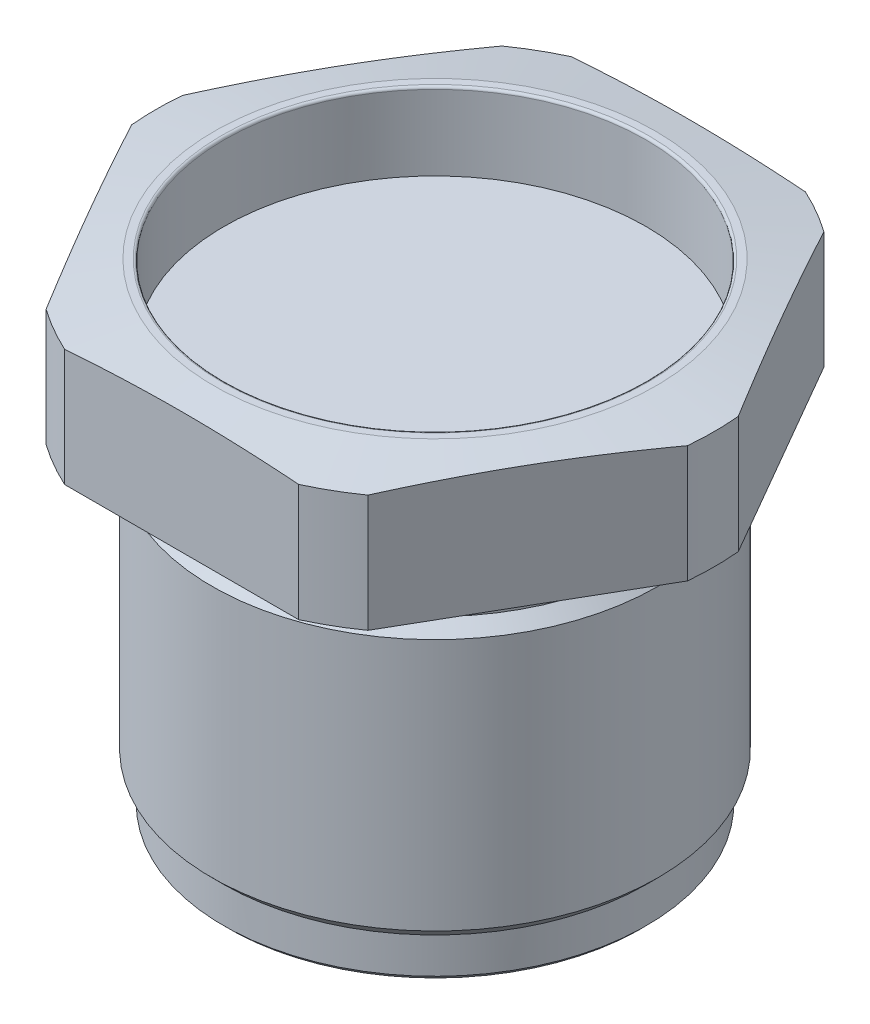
ISO-10303-21;
HEADER;
FILE_DESCRIPTION(('STEP AP214'),'2;1');
FILE_NAME('part.step','',(''),(''),'','','');
FILE_SCHEMA(('AUTOMOTIVE_DESIGN { 1 0 10303 214 1 1 1 1 }'));
ENDSEC;
DATA;
#1=APPLICATION_CONTEXT('core data for automotive mechanical design processes');
#2=APPLICATION_PROTOCOL_DEFINITION('international standard','automotive_design',2000,#1);
#3=PRODUCT_CONTEXT('',#1,'mechanical');
#4=PRODUCT('Part','Part','',(#3));
#5=PRODUCT_RELATED_PRODUCT_CATEGORY('part','',(#4));
#6=PRODUCT_DEFINITION_FORMATION('','',#4);
#7=PRODUCT_DEFINITION_CONTEXT('part definition',#1,'design');
#8=PRODUCT_DEFINITION('design','',#6,#7);
#9=PRODUCT_DEFINITION_SHAPE('','',#8);
#10=(LENGTH_UNIT() NAMED_UNIT(*) SI_UNIT(.MILLI.,.METRE.));
#11=(NAMED_UNIT(*) PLANE_ANGLE_UNIT() SI_UNIT($,.RADIAN.));
#12=(NAMED_UNIT(*) SI_UNIT($,.STERADIAN.) SOLID_ANGLE_UNIT());
#13=UNCERTAINTY_MEASURE_WITH_UNIT(LENGTH_MEASURE(1.E-05),#10,'distance_accuracy_value','');
#14=(GEOMETRIC_REPRESENTATION_CONTEXT(3) GLOBAL_UNCERTAINTY_ASSIGNED_CONTEXT((#13)) GLOBAL_UNIT_ASSIGNED_CONTEXT((#10,
#11,#12)) REPRESENTATION_CONTEXT('',''));
#15=CARTESIAN_POINT('',(0.,0.,0.));
#16=DIRECTION('',(0.,0.,1.));
#17=DIRECTION('',(1.,0.,0.));
#18=AXIS2_PLACEMENT_3D('',#15,#16,#17);
#19=CARTESIAN_POINT('',(21.0566,-34.8488,0.));
#20=DIRECTION('',(0.,-1.,0.));
#21=DIRECTION('',(0.,0.,-1.));
#22=AXIS2_PLACEMENT_3D('',#19,#20,#21);
#23=PLANE('',#22);
#24=CARTESIAN_POINT('',(0.,-34.8488,0.));
#25=DIRECTION('',(0.,-1.,0.));
#26=DIRECTION('',(0.,0.,-1.));
#27=AXIS2_PLACEMENT_3D('',#24,#25,#26);
#28=CIRCLE('',#27,18.8976);
#29=CARTESIAN_POINT('',(0.,-34.8488,-18.8976));
#30=VERTEX_POINT('',#29);
#31=EDGE_CURVE('E12',#30,#30,#28,.T.);
#32=ORIENTED_EDGE('',*,*,#31,.F.);
#33=EDGE_LOOP('',(#32));
#34=FACE_BOUND('',#33,.T.);
#35=CARTESIAN_POINT('',(0.,-34.8488,0.));
#36=DIRECTION('',(0.,-1.,0.));
#37=DIRECTION('',(0.,0.,-1.));
#38=AXIS2_PLACEMENT_3D('',#35,#36,#37);
#39=CIRCLE('',#38,20.55660224);
#40=CARTESIAN_POINT('',(0.,-34.8488,-20.55660224));
#41=VERTEX_POINT('',#40);
#42=EDGE_CURVE('E179',#41,#41,#39,.T.);
#43=ORIENTED_EDGE('',*,*,#42,.T.);
#44=EDGE_LOOP('',(#43));
#45=FACE_BOUND('',#44,.T.);
#46=ADVANCED_FACE('F35',(#34,#45),#23,.T.);
#47=CARTESIAN_POINT('',(0.,-8.96894233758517,0.));
#48=DIRECTION('',(0.,-1.,0.));
#49=DIRECTION('',(0.,0.,-1.));
#50=AXIS2_PLACEMENT_3D('',#47,#48,#49);
#51=CYLINDRICAL_SURFACE('',#50,21.0566);
#52=CARTESIAN_POINT('',(0.,-1.016,0.));
#53=DIRECTION('',(0.,-1.,0.));
#54=DIRECTION('',(0.,0.,-1.));
#55=AXIS2_PLACEMENT_3D('',#52,#53,#54);
#56=CIRCLE('',#55,21.0566);
#57=CARTESIAN_POINT('',(0.,-1.016,-21.0566));
#58=VERTEX_POINT('',#57);
#59=EDGE_CURVE('E191',#58,#58,#56,.T.);
#60=ORIENTED_EDGE('',*,*,#59,.T.);
#61=EDGE_LOOP('',(#60));
#62=FACE_BOUND('',#61,.T.);
#63=CARTESIAN_POINT('',(0.,-3.302,0.));
#64=DIRECTION('',(0.,-1.,0.));
#65=DIRECTION('',(1.,0.,0.));
#66=AXIS2_PLACEMENT_3D('',#63,#64,#65);
#67=CIRCLE('',#66,21.0566);
#68=CARTESIAN_POINT('',(21.0566,-3.302,0.));
#69=VERTEX_POINT('',#68);
#70=EDGE_CURVE('E188',#69,#69,#67,.T.);
#71=ORIENTED_EDGE('',*,*,#70,.F.);
#72=EDGE_LOOP('',(#71));
#73=FACE_BOUND('',#72,.T.);
#74=ADVANCED_FACE('F304',(#62,#73),#51,.T.);
#75=CARTESIAN_POINT('',(0.,11.6743764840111,0.));
#76=DIRECTION('',(0.,-1.,0.));
#77=DIRECTION('',(0.,0.,-1.));
#78=AXIS2_PLACEMENT_3D('',#75,#76,#77);
#79=CONICAL_SURFACE('',#78,27.813,1.39626340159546);
#80=CARTESIAN_POINT('',(0.,12.7,0.));
#81=DIRECTION('',(0.,-1.,0.));
#82=DIRECTION('',(0.,0.,-1.));
#83=AXIS2_PLACEMENT_3D('',#80,#81,#82);
#84=CIRCLE('',#83,21.9964);
#85=CARTESIAN_POINT('',(0.,12.7,-21.9964));
#86=VERTEX_POINT('',#85);
#87=EDGE_CURVE('E283',#86,#86,#84,.T.);
#88=ORIENTED_EDGE('',*,*,#87,.T.);
#89=EDGE_LOOP('',(#88));
#90=FACE_BOUND('',#89,.T.);
#91=CARTESIAN_POINT('',(0.,11.6743764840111,0.));
#92=DIRECTION('',(0.,-1.,0.));
#93=DIRECTION('',(0.,0.,-1.));
#94=AXIS2_PLACEMENT_3D('',#91,#92,#93);
#95=CIRCLE('',#94,27.813);
#96=CARTESIAN_POINT('',(-27.6981005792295,11.6743764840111,2.52550852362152));
#97=VERTEX_POINT('',#96);
#98=CARTESIAN_POINT('',(-27.6981005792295,11.6743764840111,-2.5255085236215));
#99=VERTEX_POINT('',#98);
#100=EDGE_CURVE('E139',#97,#99,#95,.T.);
#101=ORIENTED_EDGE('',*,*,#100,.F.);
#102=CARTESIAN_POINT('',(-27.699453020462,11.6741764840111,2.52316602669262));
#103=CARTESIAN_POINT('',(-27.4566948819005,11.7100797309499,2.94363545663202));
#104=CARTESIAN_POINT('',(-27.2138691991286,11.7441442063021,3.36422187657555));
#105=CARTESIAN_POINT('',(-26.7280857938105,11.8083518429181,4.20562341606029));
#106=CARTESIAN_POINT('',(-26.485128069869,11.8384949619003,4.62643853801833));
#107=CARTESIAN_POINT('',(-25.7560383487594,11.9226790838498,5.88925897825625));
#108=CARTESIAN_POINT('',(-25.269720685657,11.9704702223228,6.73158587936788));
#109=CARTESIAN_POINT('',(-24.2974521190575,12.0476317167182,8.41560443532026));
#110=CARTESIAN_POINT('',(-23.8115017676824,12.077029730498,9.25729513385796));
#111=CARTESIAN_POINT('',(-22.8394185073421,12.1163636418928,10.9409927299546));
#112=CARTESIAN_POINT('',(-22.3532856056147,12.1263002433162,11.7829996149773));
#113=CARTESIAN_POINT('',(-21.3810198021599,12.1263002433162,13.4670133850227));
#114=CARTESIAN_POINT('',(-20.8948869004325,12.1163636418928,14.3090202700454));
#115=CARTESIAN_POINT('',(-19.9228036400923,12.077029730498,15.992717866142));
#116=CARTESIAN_POINT('',(-19.4368532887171,12.0476317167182,16.8344085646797));
#117=CARTESIAN_POINT('',(-18.4645847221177,11.9704702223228,18.5184271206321));
#118=CARTESIAN_POINT('',(-17.9782670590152,11.9226790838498,19.3607540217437));
#119=CARTESIAN_POINT('',(-17.2491773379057,11.8384949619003,20.6235744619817));
#120=CARTESIAN_POINT('',(-17.0062196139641,11.8083518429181,21.0443895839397));
#121=CARTESIAN_POINT('',(-16.5204362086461,11.7441442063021,21.8857911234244));
#122=CARTESIAN_POINT('',(-16.2776105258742,11.7100797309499,22.306377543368));
#123=CARTESIAN_POINT('',(-16.0348523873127,11.6741764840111,22.7268469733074));
#124=B_SPLINE_CURVE_WITH_KNOTS('',3,(#102,#103,#104,#105,#106,#107,#108,#109,#110,#111,#112,
#113,#114,#115,#116,#117,#118,#119,#120,#121,#122,#123),.UNSPECIFIED.,.F.,.F.,(4,2,2,2,2,2,2,2,
2,2,4),(0.,1.46051952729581,2.92105480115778,5.84231114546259,8.75916415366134,11.6759116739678,
14.5926591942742,17.5095122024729,20.4307685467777,21.8913038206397,23.3518233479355),.UNSPECIFIED.);
#125=CARTESIAN_POINT('',(-16.0362048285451,11.6743764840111,22.7245044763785));
#126=VERTEX_POINT('',#125);
#127=EDGE_CURVE('E273',#97,#126,#124,.T.);
#128=ORIENTED_EDGE('',*,*,#127,.T.);
#129=CARTESIAN_POINT('',(-11.6618957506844,11.6743764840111,25.250013));
#130=VERTEX_POINT('',#129);
#131=EDGE_CURVE('E397',#130,#126,#95,.T.);
#132=ORIENTED_EDGE('',*,*,#131,.F.);
#133=CARTESIAN_POINT('',(-38.45442568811,8.466931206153,25.250013));
#134=CARTESIAN_POINT('',(-37.3088939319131,8.63573012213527,25.250013));
#135=CARTESIAN_POINT('',(-36.1630410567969,8.80238834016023,25.250013));
#136=CARTESIAN_POINT('',(-33.8705391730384,9.1302907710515,25.250013));
#137=CARTESIAN_POINT('',(-32.7238901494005,9.2915348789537,25.250013));
#138=CARTESIAN_POINT('',(-30.4291954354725,9.60753746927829,25.250013));
#139=CARTESIAN_POINT('',(-29.2811493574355,9.76229314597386,25.250013));
#140=CARTESIAN_POINT('',(-26.9839990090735,10.0637355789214,25.250013));
#141=CARTESIAN_POINT('',(-25.8348947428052,10.2104223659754,25.250013));
#142=CARTESIAN_POINT('',(-23.5393242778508,10.4933831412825,25.250013));
#143=CARTESIAN_POINT('',(-22.3928622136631,10.6296905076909,25.250013));
#144=CARTESIAN_POINT('',(-20.0985472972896,10.890150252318,25.250013));
#145=CARTESIAN_POINT('',(-18.9506944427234,11.0143026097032,25.250013));
#146=CARTESIAN_POINT('',(-16.653535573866,11.2476996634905,25.250013));
#147=CARTESIAN_POINT('',(-15.5042296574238,11.3569453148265,25.250013));
#148=CARTESIAN_POINT('',(-13.2040281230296,11.5573856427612,25.250013));
#149=CARTESIAN_POINT('',(-12.0531325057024,11.6485803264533,25.250013));
#150=CARTESIAN_POINT('',(-9.74440831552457,11.809935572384,25.250013));
#151=CARTESIAN_POINT('',(-8.5865725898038,11.87999521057,25.250013));
#152=CARTESIAN_POINT('',(-6.26965491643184,11.9952859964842,25.250013));
#153=CARTESIAN_POINT('',(-5.11057297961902,12.040517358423,25.250013));
#154=CARTESIAN_POINT('',(-2.79186198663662,12.1037192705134,25.250013));
#155=CARTESIAN_POINT('',(-1.632233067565,12.121694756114,25.250013));
#156=CARTESIAN_POINT('',(0.687119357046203,12.1293464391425,25.250013));
#157=CARTESIAN_POINT('',(1.84684286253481,12.1190226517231,25.250013));
#158=CARTESIAN_POINT('',(4.16752278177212,12.0706496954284,25.250013));
#159=CARTESIAN_POINT('',(5.32847827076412,12.0325570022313,25.250013));
#160=CARTESIAN_POINT('',(7.6492527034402,11.9307119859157,25.250013));
#161=CARTESIAN_POINT('',(8.80907163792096,11.8669594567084,25.250013));
#162=CARTESIAN_POINT('',(11.1275218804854,11.7168527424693,25.250013));
#163=CARTESIAN_POINT('',(12.2861528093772,11.6304927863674,25.250013));
#164=CARTESIAN_POINT('',(14.601809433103,11.4386022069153,25.250013));
#165=CARTESIAN_POINT('',(15.7588351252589,11.3330715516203,25.250013));
#166=CARTESIAN_POINT('',(18.0088025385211,11.1122678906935,25.250013));
#167=CARTESIAN_POINT('',(19.1018270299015,10.9978300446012,25.250013));
#168=CARTESIAN_POINT('',(21.2865901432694,10.7572197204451,25.250013));
#169=CARTESIAN_POINT('',(22.3783287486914,10.6310470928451,25.250013));
#170=CARTESIAN_POINT('',(24.5606961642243,10.3690640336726,25.250013));
#171=CARTESIAN_POINT('',(25.6513249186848,10.2332531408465,25.250013));
#172=CARTESIAN_POINT('',(27.831561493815,9.9537333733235,25.250013));
#173=CARTESIAN_POINT('',(28.9211693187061,9.81002453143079,25.250013));
#174=CARTESIAN_POINT('',(31.0996706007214,9.51609433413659,25.250013));
#175=CARTESIAN_POINT('',(32.1885639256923,9.3658720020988,25.250013));
#176=CARTESIAN_POINT('',(34.3655970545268,9.06006925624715,25.250013));
#177=CARTESIAN_POINT('',(35.4537368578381,8.90448883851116,25.250013));
#178=CARTESIAN_POINT('',(37.6293381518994,8.58888814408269,25.250013));
#179=CARTESIAN_POINT('',(38.7167996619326,8.42886800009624,25.250013));
#180=CARTESIAN_POINT('',(40.8911698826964,8.10511156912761,25.250013));
#181=CARTESIAN_POINT('',(41.9780785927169,7.94137527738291,25.250013));
#182=CARTESIAN_POINT('',(45.2288133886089,7.44692280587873,25.250013));
#183=CARTESIAN_POINT('',(47.3919393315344,7.11160393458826,25.250013));
#184=CARTESIAN_POINT('',(51.7168144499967,6.43212081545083,25.250013));
#185=CARTESIAN_POINT('',(53.8785636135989,6.08795649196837,25.250013));
#186=CARTESIAN_POINT('',(58.199655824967,5.39328895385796,25.250013));
#187=CARTESIAN_POINT('',(60.3589995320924,5.04278983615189,25.250013));
#188=CARTESIAN_POINT('',(63.5973888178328,4.51332317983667,25.250013));
#189=CARTESIAN_POINT('',(64.6767392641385,4.33621600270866,25.250013));
#190=CARTESIAN_POINT('',(66.835259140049,3.98090532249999,25.250013));
#191=CARTESIAN_POINT('',(67.9144285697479,3.80270181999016,25.250013));
#192=CARTESIAN_POINT('',(68.9935191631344,3.62402199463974,25.250013));
#193=B_SPLINE_CURVE_WITH_KNOTS('',3,(#133,#134,#135,#136,#137,#138,#139,#140,#141,#142,#143,
#144,#145,#146,#147,#148,#149,#150,#151,#152,#153,#154,#155,#156,#157,#158,#159,#160,#161,#162,
#163,#164,#165,#166,#167,#168,#169,#170,#171,#172,#173,#174,#175,#176,#177,#178,#179,#180,#181,
#182,#183,#184,#185,#186,#187,#188,#189,#190,#191,#192),.UNSPECIFIED.,.F.,.F.,(4,2,2,2,2,2,2,2,
2,2,2,2,2,2,2,2,2,2,2,2,2,2,2,2,2,2,2,2,2,4),(0.,3.47371114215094,6.9474895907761,
10.4227549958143,13.8980071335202,17.3615650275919,20.8251288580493,24.2884707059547,
27.7518111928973,31.2314371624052,34.7110331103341,38.1899989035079,41.6689628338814,
45.1533913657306,48.637847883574,52.1231947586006,55.6085474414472,58.9054693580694,
62.2024332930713,65.4995551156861,68.796663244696,72.0942674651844,75.3918740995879,
78.6893822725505,81.9868946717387,88.5537497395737,95.1206609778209,101.683467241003,
104.964820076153,108.246171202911),.UNSPECIFIED.);
#194=CARTESIAN_POINT('',(11.6618957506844,11.6743764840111,25.250013));
#195=VERTEX_POINT('',#194);
#196=EDGE_CURVE('E380',#130,#195,#193,.T.);
#197=ORIENTED_EDGE('',*,*,#196,.T.);
#198=CARTESIAN_POINT('',(16.0362048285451,11.6743764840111,22.7245044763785));
#199=VERTEX_POINT('',#198);
#200=EDGE_CURVE('E406',#199,#195,#95,.T.);
#201=ORIENTED_EDGE('',*,*,#200,.F.);
#202=CARTESIAN_POINT('',(16.0348523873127,11.6741764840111,22.7268469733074));
#203=CARTESIAN_POINT('',(16.2776105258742,11.7100797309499,22.306377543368));
#204=CARTESIAN_POINT('',(16.5204362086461,11.7441442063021,21.8857911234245));
#205=CARTESIAN_POINT('',(17.0062196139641,11.8083518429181,21.0443895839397));
#206=CARTESIAN_POINT('',(17.2491773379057,11.8384949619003,20.6235744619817));
#207=CARTESIAN_POINT('',(17.9782670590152,11.9226790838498,19.3607540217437));
#208=CARTESIAN_POINT('',(18.4645847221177,11.9704702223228,18.5184271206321));
#209=CARTESIAN_POINT('',(19.4368532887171,12.0476317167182,16.8344085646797));
#210=CARTESIAN_POINT('',(19.9228036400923,12.077029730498,15.992717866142));
#211=CARTESIAN_POINT('',(20.8948869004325,12.1163636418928,14.3090202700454));
#212=CARTESIAN_POINT('',(21.3810198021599,12.1263002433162,13.4670133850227));
#213=CARTESIAN_POINT('',(22.3532856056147,12.1263002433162,11.7829996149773));
#214=CARTESIAN_POINT('',(22.8394185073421,12.1163636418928,10.9409927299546));
#215=CARTESIAN_POINT('',(23.8115017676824,12.077029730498,9.25729513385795));
#216=CARTESIAN_POINT('',(24.2974521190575,12.0476317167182,8.41560443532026));
#217=CARTESIAN_POINT('',(25.269720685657,11.9704702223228,6.73158587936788));
#218=CARTESIAN_POINT('',(25.7560383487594,11.9226790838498,5.88925897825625));
#219=CARTESIAN_POINT('',(26.485128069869,11.8384949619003,4.62643853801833));
#220=CARTESIAN_POINT('',(26.7280857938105,11.8083518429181,4.20562341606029));
#221=CARTESIAN_POINT('',(27.2138691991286,11.7441442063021,3.36422187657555));
#222=CARTESIAN_POINT('',(27.4566948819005,11.7100797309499,2.94363545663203));
#223=CARTESIAN_POINT('',(27.699453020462,11.6741764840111,2.52316602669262));
#224=B_SPLINE_CURVE_WITH_KNOTS('',3,(#202,#203,#204,#205,#206,#207,#208,#209,#210,#211,#212,
#213,#214,#215,#216,#217,#218,#219,#220,#221,#222,#223),.UNSPECIFIED.,.F.,.F.,(4,2,2,2,2,2,2,2,
2,2,4),(0.,1.46051952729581,2.92105480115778,5.84231114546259,8.75916415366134,11.6759116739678,
14.5926591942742,17.5095122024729,20.4307685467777,21.8913038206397,23.3518233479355),.UNSPECIFIED.);
#225=CARTESIAN_POINT('',(27.6981005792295,11.6743764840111,2.5255085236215));
#226=VERTEX_POINT('',#225);
#227=EDGE_CURVE('E408',#199,#226,#224,.T.);
#228=ORIENTED_EDGE('',*,*,#227,.T.);
#229=CARTESIAN_POINT('',(27.6981005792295,11.6743764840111,-2.52550852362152));
#230=VERTEX_POINT('',#229);
#231=EDGE_CURVE('E162',#230,#226,#95,.T.);
#232=ORIENTED_EDGE('',*,*,#231,.F.);
#233=CARTESIAN_POINT('',(27.699453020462,11.6741764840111,-2.52316602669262));
#234=CARTESIAN_POINT('',(27.4566948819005,11.7100797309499,-2.94363545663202));
#235=CARTESIAN_POINT('',(27.2138691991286,11.7441442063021,-3.36422187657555));
#236=CARTESIAN_POINT('',(26.7280857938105,11.8083518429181,-4.20562341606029));
#237=CARTESIAN_POINT('',(26.485128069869,11.8384949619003,-4.62643853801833));
#238=CARTESIAN_POINT('',(25.7560383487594,11.9226790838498,-5.88925897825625));
#239=CARTESIAN_POINT('',(25.269720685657,11.9704702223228,-6.73158587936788));
#240=CARTESIAN_POINT('',(24.2974521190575,12.0476317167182,-8.41560443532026));
#241=CARTESIAN_POINT('',(23.8115017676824,12.077029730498,-9.25729513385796));
#242=CARTESIAN_POINT('',(22.8394185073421,12.1163636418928,-10.9409927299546));
#243=CARTESIAN_POINT('',(22.3532856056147,12.1263002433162,-11.7829996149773));
#244=CARTESIAN_POINT('',(21.3810198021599,12.1263002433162,-13.4670133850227));
#245=CARTESIAN_POINT('',(20.8948869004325,12.1163636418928,-14.3090202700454));
#246=CARTESIAN_POINT('',(19.9228036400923,12.077029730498,-15.992717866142));
#247=CARTESIAN_POINT('',(19.4368532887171,12.0476317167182,-16.8344085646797));
#248=CARTESIAN_POINT('',(18.4645847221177,11.9704702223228,-18.5184271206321));
#249=CARTESIAN_POINT('',(17.9782670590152,11.9226790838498,-19.3607540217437));
#250=CARTESIAN_POINT('',(17.2491773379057,11.8384949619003,-20.6235744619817));
#251=CARTESIAN_POINT('',(17.0062196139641,11.8083518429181,-21.0443895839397));
#252=CARTESIAN_POINT('',(16.5204362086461,11.7441442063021,-21.8857911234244));
#253=CARTESIAN_POINT('',(16.2776105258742,11.7100797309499,-22.306377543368));
#254=CARTESIAN_POINT('',(16.0348523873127,11.6741764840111,-22.7268469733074));
#255=B_SPLINE_CURVE_WITH_KNOTS('',3,(#233,#234,#235,#236,#237,#238,#239,#240,#241,#242,#243,
#244,#245,#246,#247,#248,#249,#250,#251,#252,#253,#254),.UNSPECIFIED.,.F.,.F.,(4,2,2,2,2,2,2,2,
2,2,4),(0.,1.46051952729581,2.92105480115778,5.84231114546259,8.75916415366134,11.6759116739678,
14.5926591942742,17.5095122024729,20.4307685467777,21.8913038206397,23.3518233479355),.UNSPECIFIED.);
#256=CARTESIAN_POINT('',(16.0362048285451,11.6743764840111,-22.7245044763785));
#257=VERTEX_POINT('',#256);
#258=EDGE_CURVE('E422',#230,#257,#255,.T.);
#259=ORIENTED_EDGE('',*,*,#258,.T.);
#260=CARTESIAN_POINT('',(11.6618957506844,11.6743764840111,-25.250013));
#261=VERTEX_POINT('',#260);
#262=EDGE_CURVE('E158',#261,#257,#95,.T.);
#263=ORIENTED_EDGE('',*,*,#262,.F.);
#264=CARTESIAN_POINT('',(-38.45442568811,8.466931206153,-25.250013));
#265=CARTESIAN_POINT('',(-37.3088939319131,8.63573012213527,-25.250013));
#266=CARTESIAN_POINT('',(-36.1630410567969,8.80238834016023,-25.250013));
#267=CARTESIAN_POINT('',(-33.8705391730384,9.1302907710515,-25.250013));
#268=CARTESIAN_POINT('',(-32.7238901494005,9.2915348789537,-25.250013));
#269=CARTESIAN_POINT('',(-30.4291954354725,9.60753746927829,-25.250013));
#270=CARTESIAN_POINT('',(-29.2811493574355,9.76229314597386,-25.250013));
#271=CARTESIAN_POINT('',(-26.9839990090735,10.0637355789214,-25.250013));
#272=CARTESIAN_POINT('',(-25.8348947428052,10.2104223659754,-25.250013));
#273=CARTESIAN_POINT('',(-23.5393242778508,10.4933831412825,-25.250013));
#274=CARTESIAN_POINT('',(-22.3928622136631,10.6296905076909,-25.250013));
#275=CARTESIAN_POINT('',(-20.0985472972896,10.890150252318,-25.250013));
#276=CARTESIAN_POINT('',(-18.9506944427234,11.0143026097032,-25.250013));
#277=CARTESIAN_POINT('',(-16.653535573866,11.2476996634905,-25.250013));
#278=CARTESIAN_POINT('',(-15.5042296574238,11.3569453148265,-25.250013));
#279=CARTESIAN_POINT('',(-13.2040281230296,11.5573856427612,-25.250013));
#280=CARTESIAN_POINT('',(-12.0531325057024,11.6485803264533,-25.250013));
#281=CARTESIAN_POINT('',(-9.74440831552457,11.809935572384,-25.250013));
#282=CARTESIAN_POINT('',(-8.5865725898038,11.87999521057,-25.250013));
#283=CARTESIAN_POINT('',(-6.26965491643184,11.9952859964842,-25.250013));
#284=CARTESIAN_POINT('',(-5.11057297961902,12.040517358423,-25.250013));
#285=CARTESIAN_POINT('',(-2.79186198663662,12.1037192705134,-25.250013));
#286=CARTESIAN_POINT('',(-1.632233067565,12.121694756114,-25.250013));
#287=CARTESIAN_POINT('',(0.687119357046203,12.1293464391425,-25.250013));
#288=CARTESIAN_POINT('',(1.84684286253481,12.1190226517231,-25.250013));
#289=CARTESIAN_POINT('',(4.16752278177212,12.0706496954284,-25.250013));
#290=CARTESIAN_POINT('',(5.32847827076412,12.0325570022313,-25.250013));
#291=CARTESIAN_POINT('',(7.6492527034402,11.9307119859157,-25.250013));
#292=CARTESIAN_POINT('',(8.80907163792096,11.8669594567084,-25.250013));
#293=CARTESIAN_POINT('',(11.1275218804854,11.7168527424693,-25.250013));
#294=CARTESIAN_POINT('',(12.2861528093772,11.6304927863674,-25.250013));
#295=CARTESIAN_POINT('',(14.601809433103,11.4386022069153,-25.250013));
#296=CARTESIAN_POINT('',(15.7588351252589,11.3330715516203,-25.250013));
#297=CARTESIAN_POINT('',(18.0088025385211,11.1122678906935,-25.250013));
#298=CARTESIAN_POINT('',(19.1018270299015,10.9978300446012,-25.250013));
#299=CARTESIAN_POINT('',(21.2865901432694,10.7572197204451,-25.250013));
#300=CARTESIAN_POINT('',(22.3783287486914,10.6310470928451,-25.250013));
#301=CARTESIAN_POINT('',(24.5606961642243,10.3690640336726,-25.250013));
#302=CARTESIAN_POINT('',(25.6513249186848,10.2332531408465,-25.250013));
#303=CARTESIAN_POINT('',(27.831561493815,9.9537333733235,-25.250013));
#304=CARTESIAN_POINT('',(28.9211693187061,9.81002453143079,-25.250013));
#305=CARTESIAN_POINT('',(31.0996706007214,9.51609433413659,-25.250013));
#306=CARTESIAN_POINT('',(32.1885639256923,9.3658720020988,-25.250013));
#307=CARTESIAN_POINT('',(34.3655970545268,9.06006925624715,-25.250013));
#308=CARTESIAN_POINT('',(35.4537368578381,8.90448883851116,-25.250013));
#309=CARTESIAN_POINT('',(37.6293381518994,8.58888814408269,-25.250013));
#310=CARTESIAN_POINT('',(38.7167996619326,8.42886800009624,-25.250013));
#311=CARTESIAN_POINT('',(40.8911698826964,8.10511156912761,-25.250013));
#312=CARTESIAN_POINT('',(41.9780785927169,7.94137527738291,-25.250013));
#313=CARTESIAN_POINT('',(45.2288133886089,7.44692280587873,-25.250013));
#314=CARTESIAN_POINT('',(47.3919393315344,7.11160393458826,-25.250013));
#315=CARTESIAN_POINT('',(51.7168144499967,6.43212081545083,-25.250013));
#316=CARTESIAN_POINT('',(53.8785636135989,6.08795649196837,-25.250013));
#317=CARTESIAN_POINT('',(58.199655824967,5.39328895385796,-25.250013));
#318=CARTESIAN_POINT('',(60.3589995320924,5.04278983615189,-25.250013));
#319=CARTESIAN_POINT('',(63.5973888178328,4.51332317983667,-25.250013));
#320=CARTESIAN_POINT('',(64.6767392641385,4.33621600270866,-25.250013));
#321=CARTESIAN_POINT('',(66.835259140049,3.98090532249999,-25.250013));
#322=CARTESIAN_POINT('',(67.9144285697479,3.80270181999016,-25.250013));
#323=CARTESIAN_POINT('',(68.9935191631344,3.62402199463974,-25.250013));
#324=B_SPLINE_CURVE_WITH_KNOTS('',3,(#264,#265,#266,#267,#268,#269,#270,#271,#272,#273,#274,
#275,#276,#277,#278,#279,#280,#281,#282,#283,#284,#285,#286,#287,#288,#289,#290,#291,#292,#293,
#294,#295,#296,#297,#298,#299,#300,#301,#302,#303,#304,#305,#306,#307,#308,#309,#310,#311,#312,
#313,#314,#315,#316,#317,#318,#319,#320,#321,#322,#323),.UNSPECIFIED.,.F.,.F.,(4,2,2,2,2,2,2,2,
2,2,2,2,2,2,2,2,2,2,2,2,2,2,2,2,2,2,2,2,2,4),(0.,3.47371114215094,6.9474895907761,
10.4227549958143,13.8980071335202,17.3615650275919,20.8251288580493,24.2884707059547,
27.7518111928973,31.2314371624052,34.7110331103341,38.1899989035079,41.6689628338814,
45.1533913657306,48.637847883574,52.1231947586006,55.6085474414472,58.9054693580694,
62.2024332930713,65.4995551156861,68.796663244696,72.0942674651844,75.3918740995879,
78.6893822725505,81.9868946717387,88.5537497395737,95.1206609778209,101.683467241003,
104.964820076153,108.246171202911),.UNSPECIFIED.);
#325=CARTESIAN_POINT('',(-11.6618957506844,11.6743764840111,-25.250013));
#326=VERTEX_POINT('',#325);
#327=EDGE_CURVE('E456',#261,#326,#324,.F.);
#328=ORIENTED_EDGE('',*,*,#327,.T.);
#329=CARTESIAN_POINT('',(-16.0362048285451,11.6743764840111,-22.7245044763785));
#330=VERTEX_POINT('',#329);
#331=EDGE_CURVE('E155',#330,#326,#95,.T.);
#332=ORIENTED_EDGE('',*,*,#331,.F.);
#333=CARTESIAN_POINT('',(-16.0348523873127,11.6741764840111,-22.7268469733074));
#334=CARTESIAN_POINT('',(-16.2776105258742,11.7100797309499,-22.306377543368));
#335=CARTESIAN_POINT('',(-16.5204362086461,11.7441442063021,-21.8857911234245));
#336=CARTESIAN_POINT('',(-17.0062196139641,11.8083518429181,-21.0443895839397));
#337=CARTESIAN_POINT('',(-17.2491773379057,11.8384949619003,-20.6235744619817));
#338=CARTESIAN_POINT('',(-17.9782670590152,11.9226790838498,-19.3607540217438));
#339=CARTESIAN_POINT('',(-18.4645847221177,11.9704702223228,-18.5184271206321));
#340=CARTESIAN_POINT('',(-19.4368532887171,12.0476317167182,-16.8344085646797));
#341=CARTESIAN_POINT('',(-19.9228036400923,12.077029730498,-15.992717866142));
#342=CARTESIAN_POINT('',(-20.8948869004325,12.1163636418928,-14.3090202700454));
#343=CARTESIAN_POINT('',(-21.3810198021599,12.1263002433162,-13.4670133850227));
#344=CARTESIAN_POINT('',(-22.3532856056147,12.1263002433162,-11.7829996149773));
#345=CARTESIAN_POINT('',(-22.8394185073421,12.1163636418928,-10.9409927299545));
#346=CARTESIAN_POINT('',(-23.8115017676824,12.077029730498,-9.25729513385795));
#347=CARTESIAN_POINT('',(-24.2974521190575,12.0476317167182,-8.41560443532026));
#348=CARTESIAN_POINT('',(-25.269720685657,11.9704702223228,-6.73158587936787));
#349=CARTESIAN_POINT('',(-25.7560383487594,11.9226790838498,-5.88925897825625));
#350=CARTESIAN_POINT('',(-26.485128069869,11.8384949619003,-4.62643853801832));
#351=CARTESIAN_POINT('',(-26.7280857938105,11.8083518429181,-4.20562341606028));
#352=CARTESIAN_POINT('',(-27.2138691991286,11.7441442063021,-3.36422187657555));
#353=CARTESIAN_POINT('',(-27.4566948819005,11.7100797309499,-2.94363545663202));
#354=CARTESIAN_POINT('',(-27.699453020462,11.6741764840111,-2.52316602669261));
#355=B_SPLINE_CURVE_WITH_KNOTS('',3,(#333,#334,#335,#336,#337,#338,#339,#340,#341,#342,#343,
#344,#345,#346,#347,#348,#349,#350,#351,#352,#353,#354),.UNSPECIFIED.,.F.,.F.,(4,2,2,2,2,2,2,2,
2,2,4),(0.,1.46051952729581,2.92105480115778,5.84231114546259,8.75916415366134,11.6759116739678,
14.5926591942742,17.5095122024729,20.4307685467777,21.8913038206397,23.3518233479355),.UNSPECIFIED.);
#356=EDGE_CURVE('E140',#330,#99,#355,.T.);
#357=ORIENTED_EDGE('',*,*,#356,.T.);
#358=EDGE_LOOP('',(#101,#128,#132,#197,#201,#228,#232,#259,#263,#328,#332,#357));
#359=FACE_BOUND('',#358,.T.);
#360=ADVANCED_FACE('F252',(#90,#359),#79,.T.);
#361=CARTESIAN_POINT('',(0.,-8.96894233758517,0.));
#362=DIRECTION('',(0.,-1.,0.));
#363=DIRECTION('',(0.,0.,-1.));
#364=AXIS2_PLACEMENT_3D('',#361,#362,#363);
#365=CYLINDRICAL_SURFACE('',#364,27.813);
#366=CARTESIAN_POINT('',(0.,0.,0.));
#367=DIRECTION('',(0.,-1.,0.));
#368=DIRECTION('',(0.,0.,-1.));
#369=AXIS2_PLACEMENT_3D('',#366,#367,#368);
#370=CIRCLE('',#369,27.813);
#371=CARTESIAN_POINT('',(-27.6981005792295,0.,2.52550852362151));
#372=VERTEX_POINT('',#371);
#373=CARTESIAN_POINT('',(-27.6981005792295,0.,-2.5255085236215));
#374=VERTEX_POINT('',#373);
#375=EDGE_CURVE('E137',#372,#374,#370,.T.);
#376=ORIENTED_EDGE('',*,*,#375,.F.);
#377=DIRECTION('',(0.,-1.,0.));
#378=VECTOR('',#377,1.);
#379=CARTESIAN_POINT('',(-27.6981005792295,-8.96894233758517,2.5255085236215));
#380=LINE('',#379,#378);
#381=EDGE_CURVE('E58',#372,#97,#380,.F.);
#382=ORIENTED_EDGE('',*,*,#381,.T.);
#383=ORIENTED_EDGE('',*,*,#100,.T.);
#384=DIRECTION('',(0.,-1.,0.));
#385=VECTOR('',#384,1.);
#386=CARTESIAN_POINT('',(-27.6981005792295,-8.96894233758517,-2.5255085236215));
#387=LINE('',#386,#385);
#388=EDGE_CURVE('E124',#99,#374,#387,.T.);
#389=ORIENTED_EDGE('',*,*,#388,.T.);
#390=EDGE_LOOP('',(#376,#382,#383,#389));
#391=FACE_BOUND('',#390,.T.);
#392=ADVANCED_FACE('F136',(#391),#365,.T.);
#393=ORIENTED_EDGE('',*,*,#131,.T.);
#394=DIRECTION('',(0.,-1.,0.));
#395=VECTOR('',#394,1.);
#396=CARTESIAN_POINT('',(-16.0362048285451,-8.96894233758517,22.7245044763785));
#397=LINE('',#396,#395);
#398=CARTESIAN_POINT('',(-16.0362048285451,0.,22.7245044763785));
#399=VERTEX_POINT('',#398);
#400=EDGE_CURVE('E281',#126,#399,#397,.T.);
#401=ORIENTED_EDGE('',*,*,#400,.T.);
#402=CARTESIAN_POINT('',(-11.6618957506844,0.,25.250013));
#403=VERTEX_POINT('',#402);
#404=EDGE_CURVE('E146',#403,#399,#370,.T.);
#405=ORIENTED_EDGE('',*,*,#404,.F.);
#406=DIRECTION('',(0.,-1.,0.));
#407=VECTOR('',#406,1.);
#408=CARTESIAN_POINT('',(-11.6618957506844,-8.96894233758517,25.250013));
#409=LINE('',#408,#407);
#410=EDGE_CURVE('E387',#403,#130,#409,.F.);
#411=ORIENTED_EDGE('',*,*,#410,.T.);
#412=EDGE_LOOP('',(#393,#401,#405,#411));
#413=FACE_BOUND('',#412,.T.);
#414=ADVANCED_FACE('F396',(#413),#365,.T.);
#415=ORIENTED_EDGE('',*,*,#200,.T.);
#416=DIRECTION('',(0.,-1.,0.));
#417=VECTOR('',#416,1.);
#418=CARTESIAN_POINT('',(11.6618957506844,-8.96894233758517,25.250013));
#419=LINE('',#418,#417);
#420=CARTESIAN_POINT('',(11.6618957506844,0.,25.250013));
#421=VERTEX_POINT('',#420);
#422=EDGE_CURVE('E388',#195,#421,#419,.T.);
#423=ORIENTED_EDGE('',*,*,#422,.T.);
#424=CARTESIAN_POINT('',(16.0362048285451,0.,22.7245044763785));
#425=VERTEX_POINT('',#424);
#426=EDGE_CURVE('E149',#425,#421,#370,.T.);
#427=ORIENTED_EDGE('',*,*,#426,.F.);
#428=DIRECTION('',(0.,-1.,0.));
#429=VECTOR('',#428,1.);
#430=CARTESIAN_POINT('',(16.0362048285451,-8.96894233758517,22.7245044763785));
#431=LINE('',#430,#429);
#432=EDGE_CURVE('E407',#425,#199,#431,.F.);
#433=ORIENTED_EDGE('',*,*,#432,.T.);
#434=EDGE_LOOP('',(#415,#423,#427,#433));
#435=FACE_BOUND('',#434,.T.);
#436=ADVANCED_FACE('F403',(#435),#365,.T.);
#437=ORIENTED_EDGE('',*,*,#231,.T.);
#438=DIRECTION('',(0.,-1.,0.));
#439=VECTOR('',#438,1.);
#440=CARTESIAN_POINT('',(27.6981005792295,-8.96894233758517,2.5255085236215));
#441=LINE('',#440,#439);
#442=CARTESIAN_POINT('',(27.6981005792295,0.,2.5255085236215));
#443=VERTEX_POINT('',#442);
#444=EDGE_CURVE('E410',#226,#443,#441,.T.);
#445=ORIENTED_EDGE('',*,*,#444,.T.);
#446=CARTESIAN_POINT('',(27.6981005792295,0.,-2.52550852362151));
#447=VERTEX_POINT('',#446);
#448=EDGE_CURVE('E156',#447,#443,#370,.T.);
#449=ORIENTED_EDGE('',*,*,#448,.F.);
#450=DIRECTION('',(0.,-1.,0.));
#451=VECTOR('',#450,1.);
#452=CARTESIAN_POINT('',(27.6981005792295,-8.96894233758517,-2.5255085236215));
#453=LINE('',#452,#451);
#454=EDGE_CURVE('E419',#447,#230,#453,.F.);
#455=ORIENTED_EDGE('',*,*,#454,.T.);
#456=EDGE_LOOP('',(#437,#445,#449,#455));
#457=FACE_BOUND('',#456,.T.);
#458=ADVANCED_FACE('F466',(#457),#365,.T.);
#459=ORIENTED_EDGE('',*,*,#262,.T.);
#460=DIRECTION('',(0.,-1.,0.));
#461=VECTOR('',#460,1.);
#462=CARTESIAN_POINT('',(16.0362048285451,-8.96894233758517,-22.7245044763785));
#463=LINE('',#462,#461);
#464=CARTESIAN_POINT('',(16.0362048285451,0.,-22.7245044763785));
#465=VERTEX_POINT('',#464);
#466=EDGE_CURVE('E429',#257,#465,#463,.T.);
#467=ORIENTED_EDGE('',*,*,#466,.T.);
#468=CARTESIAN_POINT('',(11.6618957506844,0.,-25.250013));
#469=VERTEX_POINT('',#468);
#470=EDGE_CURVE('E151',#469,#465,#370,.T.);
#471=ORIENTED_EDGE('',*,*,#470,.F.);
#472=DIRECTION('',(0.,-1.,0.));
#473=VECTOR('',#472,1.);
#474=CARTESIAN_POINT('',(11.6618957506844,-8.96894233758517,-25.250013));
#475=LINE('',#474,#473);
#476=EDGE_CURVE('E449',#469,#261,#475,.F.);
#477=ORIENTED_EDGE('',*,*,#476,.T.);
#478=EDGE_LOOP('',(#459,#467,#471,#477));
#479=FACE_BOUND('',#478,.T.);
#480=ADVANCED_FACE('F446',(#479),#365,.T.);
#481=ORIENTED_EDGE('',*,*,#331,.T.);
#482=DIRECTION('',(0.,-1.,0.));
#483=VECTOR('',#482,1.);
#484=CARTESIAN_POINT('',(-11.6618957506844,-8.96894233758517,-25.250013));
#485=LINE('',#484,#483);
#486=CARTESIAN_POINT('',(-11.6618957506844,0.,-25.250013));
#487=VERTEX_POINT('',#486);
#488=EDGE_CURVE('E451',#326,#487,#485,.T.);
#489=ORIENTED_EDGE('',*,*,#488,.T.);
#490=CARTESIAN_POINT('',(-16.0362048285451,0.,-22.7245044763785));
#491=VERTEX_POINT('',#490);
#492=EDGE_CURVE('E147',#491,#487,#370,.T.);
#493=ORIENTED_EDGE('',*,*,#492,.F.);
#494=DIRECTION('',(0.,-1.,0.));
#495=VECTOR('',#494,1.);
#496=CARTESIAN_POINT('',(-16.0362048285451,-8.96894233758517,-22.7245044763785));
#497=LINE('',#496,#495);
#498=EDGE_CURVE('E50',#491,#330,#497,.F.);
#499=ORIENTED_EDGE('',*,*,#498,.T.);
#500=EDGE_LOOP('',(#481,#489,#493,#499));
#501=FACE_BOUND('',#500,.T.);
#502=ADVANCED_FACE('F300',(#501),#365,.T.);
#503=CARTESIAN_POINT('',(27.813,0.,0.));
#504=DIRECTION('',(0.,-1.,0.));
#505=DIRECTION('',(0.,0.,-1.));
#506=AXIS2_PLACEMENT_3D('',#503,#504,#505);
#507=PLANE('',#506);
#508=CARTESIAN_POINT('',(0.,0.,0.));
#509=DIRECTION('',(0.,-1.,0.));
#510=DIRECTION('',(0.,0.,-1.));
#511=AXIS2_PLACEMENT_3D('',#508,#509,#510);
#512=CIRCLE('',#511,22.0726);
#513=CARTESIAN_POINT('',(0.,0.,-22.0726));
#514=VERTEX_POINT('',#513);
#515=EDGE_CURVE('E194',#514,#514,#512,.F.);
#516=ORIENTED_EDGE('',*,*,#515,.T.);
#517=EDGE_LOOP('',(#516));
#518=FACE_BOUND('',#517,.T.);
#519=ORIENTED_EDGE('',*,*,#404,.T.);
#520=DIRECTION('',(-0.5,0.,-0.866025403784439));
#521=VECTOR('',#520,1.);
#522=CARTESIAN_POINT('',(-14.9139027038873,0.,24.6683887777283));
#523=LINE('',#522,#521);
#524=EDGE_CURVE('E145',#399,#372,#523,.T.);
#525=ORIENTED_EDGE('',*,*,#524,.T.);
#526=ORIENTED_EDGE('',*,*,#375,.T.);
#527=DIRECTION('',(0.5,0.,-0.866025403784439));
#528=VECTOR('',#527,1.);
#529=CARTESIAN_POINT('',(-14.9139027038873,0.,-24.6683887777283));
#530=LINE('',#529,#528);
#531=EDGE_CURVE('E121',#374,#491,#530,.T.);
#532=ORIENTED_EDGE('',*,*,#531,.T.);
#533=ORIENTED_EDGE('',*,*,#492,.T.);
#534=DIRECTION('',(1.,0.,0.));
#535=VECTOR('',#534,1.);
#536=CARTESIAN_POINT('',(27.813,0.,-25.250013));
#537=LINE('',#536,#535);
#538=EDGE_CURVE('E130',#487,#469,#537,.T.);
#539=ORIENTED_EDGE('',*,*,#538,.T.);
#540=ORIENTED_EDGE('',*,*,#470,.T.);
#541=DIRECTION('',(0.5,0.,0.866025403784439));
#542=VECTOR('',#541,1.);
#543=CARTESIAN_POINT('',(28.8204027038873,0.,-0.581624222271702));
#544=LINE('',#543,#542);
#545=EDGE_CURVE('E169',#465,#447,#544,.T.);
#546=ORIENTED_EDGE('',*,*,#545,.T.);
#547=ORIENTED_EDGE('',*,*,#448,.T.);
#548=DIRECTION('',(-0.5,0.,0.866025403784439));
#549=VECTOR('',#548,1.);
#550=CARTESIAN_POINT('',(28.8204027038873,0.,0.581624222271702));
#551=LINE('',#550,#549);
#552=EDGE_CURVE('E172',#443,#425,#551,.T.);
#553=ORIENTED_EDGE('',*,*,#552,.T.);
#554=ORIENTED_EDGE('',*,*,#426,.T.);
#555=DIRECTION('',(-1.,0.,0.));
#556=VECTOR('',#555,1.);
#557=CARTESIAN_POINT('',(27.813,0.,25.250013));
#558=LINE('',#557,#556);
#559=EDGE_CURVE('E175',#421,#403,#558,.T.);
#560=ORIENTED_EDGE('',*,*,#559,.T.);
#561=EDGE_LOOP('',(#519,#525,#526,#532,#533,#539,#540,#546,#547,#553,#554,#560));
#562=FACE_BOUND('',#561,.T.);
#563=ADVANCED_FACE('F144',(#518,#562),#507,.T.);
#564=CARTESIAN_POINT('',(21.0185,4.9784,0.));
#565=DIRECTION('',(0.,1.,0.));
#566=DIRECTION('',(0.,0.,1.));
#567=AXIS2_PLACEMENT_3D('',#564,#565,#566);
#568=PLANE('',#567);
#569=CARTESIAN_POINT('',(0.,4.9784,0.));
#570=DIRECTION('',(0.,-1.,0.));
#571=DIRECTION('',(0.,0.,-1.));
#572=AXIS2_PLACEMENT_3D('',#569,#570,#571);
#573=CIRCLE('',#572,21.0185);
#574=CARTESIAN_POINT('',(0.,4.9784,-21.0185));
#575=VERTEX_POINT('',#574);
#576=EDGE_CURVE('E150',#575,#575,#573,.T.);
#577=ORIENTED_EDGE('',*,*,#576,.F.);
#578=EDGE_LOOP('',(#577));
#579=FACE_BOUND('',#578,.T.);
#580=ADVANCED_FACE('F292',(#579),#568,.T.);
#581=CARTESIAN_POINT('',(0.,-8.96894233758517,0.));
#582=DIRECTION('',(0.,-1.,0.));
#583=DIRECTION('',(0.,0.,-1.));
#584=AXIS2_PLACEMENT_3D('',#581,#582,#583);
#585=CYLINDRICAL_SURFACE('',#584,21.0185);
#586=CARTESIAN_POINT('',(0.,12.45,0.));
#587=DIRECTION('',(0.,1.,0.));
#588=DIRECTION('',(0.,0.,1.));
#589=AXIS2_PLACEMENT_3D('',#586,#587,#588);
#590=CIRCLE('',#589,21.0185);
#591=CARTESIAN_POINT('',(0.,12.45,21.0185));
#592=VERTEX_POINT('',#591);
#593=EDGE_CURVE('E131',#592,#592,#590,.T.);
#594=ORIENTED_EDGE('',*,*,#593,.T.);
#595=EDGE_LOOP('',(#594));
#596=FACE_BOUND('',#595,.T.);
#597=ORIENTED_EDGE('',*,*,#576,.T.);
#598=EDGE_LOOP('',(#597));
#599=FACE_BOUND('',#598,.T.);
#600=ADVANCED_FACE('F290',(#596,#599),#585,.F.);
#601=CARTESIAN_POINT('',(21.0185,12.7,0.));
#602=DIRECTION('',(0.,1.,0.));
#603=DIRECTION('',(0.,0.,1.));
#604=AXIS2_PLACEMENT_3D('',#601,#602,#603);
#605=PLANE('',#604);
#606=CARTESIAN_POINT('',(0.,12.7,0.));
#607=DIRECTION('',(0.,1.,0.));
#608=DIRECTION('',(0.,0.,1.));
#609=AXIS2_PLACEMENT_3D('',#606,#607,#608);
#610=CIRCLE('',#609,21.2685);
#611=CARTESIAN_POINT('',(0.,12.7,21.2685));
#612=VERTEX_POINT('',#611);
#613=EDGE_CURVE('E161',#612,#612,#610,.F.);
#614=ORIENTED_EDGE('',*,*,#613,.T.);
#615=EDGE_LOOP('',(#614));
#616=FACE_BOUND('',#615,.T.);
#617=ORIENTED_EDGE('',*,*,#87,.F.);
#618=EDGE_LOOP('',(#617));
#619=FACE_BOUND('',#618,.T.);
#620=ADVANCED_FACE('F270',(#616,#619),#605,.T.);
#621=CARTESIAN_POINT('',(0.,12.45,0.));
#622=DIRECTION('',(0.,1.,0.));
#623=DIRECTION('',(0.,0.,1.));
#624=AXIS2_PLACEMENT_3D('',#621,#622,#623);
#625=TOROIDAL_SURFACE('',#624,21.2685,0.25);
#626=ORIENTED_EDGE('',*,*,#593,.F.);
#627=EDGE_LOOP('',(#626));
#628=FACE_BOUND('',#627,.T.);
#629=ORIENTED_EDGE('',*,*,#613,.F.);
#630=EDGE_LOOP('',(#629));
#631=FACE_BOUND('',#630,.T.);
#632=ADVANCED_FACE('F261',(#628,#631),#625,.T.);
#633=CARTESIAN_POINT('',(-14.5781018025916,12.7,-25.250013));
#634=DIRECTION('',(-0.866025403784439,0.,-0.5));
#635=DIRECTION('',(-0.5,0.,0.866025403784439));
#636=AXIS2_PLACEMENT_3D('',#633,#634,#635);
#637=PLANE('',#636);
#638=ORIENTED_EDGE('',*,*,#531,.F.);
#639=ORIENTED_EDGE('',*,*,#388,.F.);
#640=ORIENTED_EDGE('',*,*,#356,.F.);
#641=ORIENTED_EDGE('',*,*,#498,.F.);
#642=EDGE_LOOP('',(#638,#639,#640,#641));
#643=FACE_BOUND('',#642,.T.);
#644=ADVANCED_FACE('F123',(#643),#637,.T.);
#645=CARTESIAN_POINT('',(14.5781018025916,12.7,-25.250013));
#646=DIRECTION('',(0.,0.,-1.));
#647=DIRECTION('',(-1.,0.,0.));
#648=AXIS2_PLACEMENT_3D('',#645,#646,#647);
#649=PLANE('',#648);
#650=ORIENTED_EDGE('',*,*,#538,.F.);
#651=ORIENTED_EDGE('',*,*,#488,.F.);
#652=ORIENTED_EDGE('',*,*,#327,.F.);
#653=ORIENTED_EDGE('',*,*,#476,.F.);
#654=EDGE_LOOP('',(#650,#651,#652,#653));
#655=FACE_BOUND('',#654,.T.);
#656=ADVANCED_FACE('F260',(#655),#649,.T.);
#657=CARTESIAN_POINT('',(29.1562036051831,12.7,0.));
#658=DIRECTION('',(0.866025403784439,0.,-0.5));
#659=DIRECTION('',(-0.5,0.,-0.866025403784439));
#660=AXIS2_PLACEMENT_3D('',#657,#658,#659);
#661=PLANE('',#660);
#662=ORIENTED_EDGE('',*,*,#545,.F.);
#663=ORIENTED_EDGE('',*,*,#466,.F.);
#664=ORIENTED_EDGE('',*,*,#258,.F.);
#665=ORIENTED_EDGE('',*,*,#454,.F.);
#666=EDGE_LOOP('',(#662,#663,#664,#665));
#667=FACE_BOUND('',#666,.T.);
#668=ADVANCED_FACE('F431',(#667),#661,.T.);
#669=CARTESIAN_POINT('',(14.5781018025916,12.7,25.250013));
#670=DIRECTION('',(0.866025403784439,0.,0.5));
#671=DIRECTION('',(0.5,0.,-0.866025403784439));
#672=AXIS2_PLACEMENT_3D('',#669,#670,#671);
#673=PLANE('',#672);
#674=ORIENTED_EDGE('',*,*,#552,.F.);
#675=ORIENTED_EDGE('',*,*,#444,.F.);
#676=ORIENTED_EDGE('',*,*,#227,.F.);
#677=ORIENTED_EDGE('',*,*,#432,.F.);
#678=EDGE_LOOP('',(#674,#675,#676,#677));
#679=FACE_BOUND('',#678,.T.);
#680=ADVANCED_FACE('F376',(#679),#673,.T.);
#681=CARTESIAN_POINT('',(-14.5781018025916,12.7,25.250013));
#682=DIRECTION('',(0.,0.,1.));
#683=DIRECTION('',(1.,0.,0.));
#684=AXIS2_PLACEMENT_3D('',#681,#682,#683);
#685=PLANE('',#684);
#686=ORIENTED_EDGE('',*,*,#559,.F.);
#687=ORIENTED_EDGE('',*,*,#422,.F.);
#688=ORIENTED_EDGE('',*,*,#196,.F.);
#689=ORIENTED_EDGE('',*,*,#410,.F.);
#690=EDGE_LOOP('',(#686,#687,#688,#689));
#691=FACE_BOUND('',#690,.T.);
#692=ADVANCED_FACE('F269',(#691),#685,.T.);
#693=CARTESIAN_POINT('',(-29.1562036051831,12.7,0.));
#694=DIRECTION('',(-0.866025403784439,0.,0.5));
#695=DIRECTION('',(0.5,0.,0.866025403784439));
#696=AXIS2_PLACEMENT_3D('',#693,#694,#695);
#697=PLANE('',#696);
#698=ORIENTED_EDGE('',*,*,#524,.F.);
#699=ORIENTED_EDGE('',*,*,#400,.F.);
#700=ORIENTED_EDGE('',*,*,#127,.F.);
#701=ORIENTED_EDGE('',*,*,#381,.F.);
#702=EDGE_LOOP('',(#698,#699,#700,#701));
#703=FACE_BOUND('',#702,.T.);
#704=ADVANCED_FACE('F264',(#703),#697,.T.);
#705=CARTESIAN_POINT('',(0.,-3.302,0.));
#706=DIRECTION('',(0.,-1.,0.));
#707=DIRECTION('',(1.,0.,0.));
#708=AXIS2_PLACEMENT_3D('',#705,#706,#707);
#709=CONICAL_SURFACE('',#708,21.0566,0.785398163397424);
#710=CARTESIAN_POINT('',(0.,-4.47040000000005,0.));
#711=DIRECTION('',(0.,1.,0.));
#712=DIRECTION('',(-1.,0.,0.));
#713=AXIS2_PLACEMENT_3D('',#710,#711,#712);
#714=CIRCLE('',#713,22.225);
#715=CARTESIAN_POINT('',(-22.225,-4.47040000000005,0.));
#716=VERTEX_POINT('',#715);
#717=EDGE_CURVE('E141',#716,#716,#714,.T.);
#718=ORIENTED_EDGE('',*,*,#717,.T.);
#719=EDGE_LOOP('',(#718));
#720=FACE_BOUND('',#719,.T.);
#721=ORIENTED_EDGE('',*,*,#70,.T.);
#722=EDGE_LOOP('',(#721));
#723=FACE_BOUND('',#722,.T.);
#724=ADVANCED_FACE('F268',(#720,#723),#709,.T.);
#725=CARTESIAN_POINT('',(0.,0.,0.));
#726=DIRECTION('',(0.,1.,0.));
#727=DIRECTION('',(-1.,0.,0.));
#728=AXIS2_PLACEMENT_3D('',#725,#726,#727);
#729=CYLINDRICAL_SURFACE('',#728,22.225);
#730=CARTESIAN_POINT('',(0.,-29.6164000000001,0.));
#731=DIRECTION('',(0.,1.,0.));
#732=DIRECTION('',(-1.,0.,0.));
#733=AXIS2_PLACEMENT_3D('',#730,#731,#732);
#734=CIRCLE('',#733,22.225);
#735=CARTESIAN_POINT('',(-22.225,-29.6164000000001,0.));
#736=VERTEX_POINT('',#735);
#737=EDGE_CURVE('E239',#736,#736,#734,.T.);
#738=ORIENTED_EDGE('',*,*,#737,.T.);
#739=EDGE_LOOP('',(#738));
#740=FACE_BOUND('',#739,.T.);
#741=ORIENTED_EDGE('',*,*,#717,.F.);
#742=EDGE_LOOP('',(#741));
#743=FACE_BOUND('',#742,.T.);
#744=ADVANCED_FACE('F365',(#740,#743),#729,.T.);
#745=CARTESIAN_POINT('',(0.,-29.6164000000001,0.));
#746=DIRECTION('',(0.,1.,0.));
#747=DIRECTION('',(-1.,0.,0.));
#748=AXIS2_PLACEMENT_3D('',#745,#746,#747);
#749=CONICAL_SURFACE('',#748,22.225,0.785398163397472);
#750=CARTESIAN_POINT('',(0.,-30.7848,0.));
#751=DIRECTION('',(0.,1.,0.));
#752=DIRECTION('',(-1.,0.,0.));
#753=AXIS2_PLACEMENT_3D('',#750,#751,#752);
#754=CIRCLE('',#753,21.0566);
#755=CARTESIAN_POINT('',(-21.0566,-30.7848,0.));
#756=VERTEX_POINT('',#755);
#757=EDGE_CURVE('E185',#756,#756,#754,.T.);
#758=ORIENTED_EDGE('',*,*,#757,.T.);
#759=EDGE_LOOP('',(#758));
#760=FACE_BOUND('',#759,.T.);
#761=ORIENTED_EDGE('',*,*,#737,.F.);
#762=EDGE_LOOP('',(#761));
#763=FACE_BOUND('',#762,.T.);
#764=ADVANCED_FACE('F361',(#760,#763),#749,.T.);
#765=CARTESIAN_POINT('',(0.,-34.8488,0.));
#766=DIRECTION('',(0.,1.,0.));
#767=DIRECTION('',(0.,0.,1.));
#768=AXIS2_PLACEMENT_3D('',#765,#766,#767);
#769=CONICAL_SURFACE('',#768,20.55660224,0.785398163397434);
#770=CARTESIAN_POINT('',(0.,-34.34880224,0.));
#771=DIRECTION('',(0.,-1.,0.));
#772=DIRECTION('',(0.,0.,-1.));
#773=AXIS2_PLACEMENT_3D('',#770,#771,#772);
#774=CIRCLE('',#773,21.0566);
#775=CARTESIAN_POINT('',(0.,-34.34880224,-21.0566));
#776=VERTEX_POINT('',#775);
#777=EDGE_CURVE('E182',#776,#776,#774,.F.);
#778=ORIENTED_EDGE('',*,*,#777,.F.);
#779=EDGE_LOOP('',(#778));
#780=FACE_BOUND('',#779,.T.);
#781=ORIENTED_EDGE('',*,*,#42,.F.);
#782=EDGE_LOOP('',(#781));
#783=FACE_BOUND('',#782,.T.);
#784=ADVANCED_FACE('F364',(#780,#783),#769,.T.);
#785=ORIENTED_EDGE('',*,*,#757,.F.);
#786=EDGE_LOOP('',(#785));
#787=FACE_BOUND('',#786,.T.);
#788=ORIENTED_EDGE('',*,*,#777,.T.);
#789=EDGE_LOOP('',(#788));
#790=FACE_BOUND('',#789,.T.);
#791=ADVANCED_FACE('F312',(#787,#790),#51,.T.);
#792=CARTESIAN_POINT('',(0.,-1.016,0.));
#793=DIRECTION('',(0.,-1.,0.));
#794=DIRECTION('',(0.,0.,-1.));
#795=AXIS2_PLACEMENT_3D('',#792,#793,#794);
#796=TOROIDAL_SURFACE('',#795,22.0726,1.016);
#797=ORIENTED_EDGE('',*,*,#515,.F.);
#798=EDGE_LOOP('',(#797));
#799=FACE_BOUND('',#798,.T.);
#800=ORIENTED_EDGE('',*,*,#59,.F.);
#801=EDGE_LOOP('',(#800));
#802=FACE_BOUND('',#801,.T.);
#803=ADVANCED_FACE('F37',(#799,#802),#796,.F.);
#804=CARTESIAN_POINT('',(0.,-34.3154,0.));
#805=DIRECTION('',(0.,1.,0.));
#806=DIRECTION('',(0.,0.,1.));
#807=AXIS2_PLACEMENT_3D('',#804,#805,#806);
#808=TOROIDAL_SURFACE('',#807,18.1864,0.889000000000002);
#809=ORIENTED_EDGE('',*,*,#31,.T.);
#810=EDGE_LOOP('',(#809));
#811=FACE_BOUND('',#810,.T.);
#812=CARTESIAN_POINT('',(0.,-34.8488,0.));
#813=DIRECTION('',(0.,1.,0.));
#814=DIRECTION('',(0.,0.,1.));
#815=AXIS2_PLACEMENT_3D('',#812,#813,#814);
#816=CIRCLE('',#815,17.4752);
#817=CARTESIAN_POINT('',(0.,-34.8488,17.4752));
#818=VERTEX_POINT('',#817);
#819=EDGE_CURVE('E43',#818,#818,#816,.T.);
#820=ORIENTED_EDGE('',*,*,#819,.T.);
#821=EDGE_LOOP('',(#820));
#822=FACE_BOUND('',#821,.T.);
#823=ADVANCED_FACE('F199',(#811,#822),#808,.T.);
#824=CARTESIAN_POINT('',(0.,-33.4772,0.));
#825=DIRECTION('',(0.,-1.,0.));
#826=DIRECTION('',(1.,0.,0.));
#827=AXIS2_PLACEMENT_3D('',#824,#825,#826);
#828=PLANE('',#827);
#829=CARTESIAN_POINT('',(0.,-33.4772,0.));
#830=DIRECTION('',(0.,1.,0.));
#831=DIRECTION('',(-1.,0.,0.));
#832=AXIS2_PLACEMENT_3D('',#829,#830,#831);
#833=CIRCLE('',#832,7.5819);
#834=CARTESIAN_POINT('',(-7.5819,-33.4772,0.));
#835=VERTEX_POINT('',#834);
#836=EDGE_CURVE('E236',#835,#835,#833,.T.);
#837=ORIENTED_EDGE('',*,*,#836,.F.);
#838=EDGE_LOOP('',(#837));
#839=FACE_BOUND('',#838,.T.);
#840=ADVANCED_FACE('F340',(#839),#828,.T.);
#841=CARTESIAN_POINT('',(0.,0.,0.));
#842=DIRECTION('',(0.,1.,0.));
#843=DIRECTION('',(-1.,0.,0.));
#844=AXIS2_PLACEMENT_3D('',#841,#842,#843);
#845=CYLINDRICAL_SURFACE('',#844,7.5819);
#846=ORIENTED_EDGE('',*,*,#836,.T.);
#847=EDGE_LOOP('',(#846));
#848=FACE_BOUND('',#847,.T.);
#849=CARTESIAN_POINT('',(0.,-34.8488,0.));
#850=DIRECTION('',(0.,1.,0.));
#851=DIRECTION('',(-1.,0.,0.));
#852=AXIS2_PLACEMENT_3D('',#849,#850,#851);
#853=CIRCLE('',#852,7.5819);
#854=CARTESIAN_POINT('',(-7.5819,-34.8488,0.));
#855=VERTEX_POINT('',#854);
#856=EDGE_CURVE('E233',#855,#855,#853,.T.);
#857=ORIENTED_EDGE('',*,*,#856,.F.);
#858=EDGE_LOOP('',(#857));
#859=FACE_BOUND('',#858,.T.);
#860=ADVANCED_FACE('F332',(#848,#859),#845,.F.);
#861=ORIENTED_EDGE('',*,*,#856,.T.);
#862=EDGE_LOOP('',(#861));
#863=FACE_BOUND('',#862,.T.);
#864=CARTESIAN_POINT('',(0.,-34.8488,0.));
#865=DIRECTION('',(0.,1.,0.));
#866=DIRECTION('',(-1.,0.,0.));
#867=AXIS2_PLACEMENT_3D('',#864,#865,#866);
#868=CIRCLE('',#867,9.3853);
#869=CARTESIAN_POINT('',(-9.38529999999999,-34.8488,0.));
#870=VERTEX_POINT('',#869);
#871=EDGE_CURVE('E227',#870,#870,#868,.T.);
#872=ORIENTED_EDGE('',*,*,#871,.F.);
#873=EDGE_LOOP('',(#872));
#874=FACE_BOUND('',#873,.T.);
#875=ADVANCED_FACE('F206',(#863,#874),#23,.T.);
#876=CARTESIAN_POINT('',(0.,0.,0.));
#877=DIRECTION('',(0.,1.,0.));
#878=DIRECTION('',(-1.,0.,0.));
#879=AXIS2_PLACEMENT_3D('',#876,#877,#878);
#880=CYLINDRICAL_SURFACE('',#879,9.3853);
#881=ORIENTED_EDGE('',*,*,#871,.T.);
#882=EDGE_LOOP('',(#881));
#883=FACE_BOUND('',#882,.T.);
#884=CARTESIAN_POINT('',(0.,-34.3154,0.));
#885=DIRECTION('',(0.,1.,0.));
#886=DIRECTION('',(-1.,0.,0.));
#887=AXIS2_PLACEMENT_3D('',#884,#885,#886);
#888=CIRCLE('',#887,9.3853);
#889=CARTESIAN_POINT('',(-9.38529999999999,-34.3154,0.));
#890=VERTEX_POINT('',#889);
#891=EDGE_CURVE('E230',#890,#890,#888,.T.);
#892=ORIENTED_EDGE('',*,*,#891,.F.);
#893=EDGE_LOOP('',(#892));
#894=FACE_BOUND('',#893,.T.);
#895=ADVANCED_FACE('F331',(#883,#894),#880,.T.);
#896=CARTESIAN_POINT('',(0.,-34.3154,0.));
#897=DIRECTION('',(0.,1.,0.));
#898=DIRECTION('',(-1.,0.,0.));
#899=AXIS2_PLACEMENT_3D('',#896,#897,#898);
#900=TOROIDAL_SURFACE('',#899,10.2743,0.888999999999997);
#901=ORIENTED_EDGE('',*,*,#891,.T.);
#902=EDGE_LOOP('',(#901));
#903=FACE_BOUND('',#902,.T.);
#904=CARTESIAN_POINT('',(0.,-34.3154,0.));
#905=DIRECTION('',(0.,1.,0.));
#906=DIRECTION('',(-1.,0.,0.));
#907=AXIS2_PLACEMENT_3D('',#904,#905,#906);
#908=CIRCLE('',#907,11.1633);
#909=CARTESIAN_POINT('',(-11.1633,-34.3154,0.));
#910=VERTEX_POINT('',#909);
#911=EDGE_CURVE('E215',#910,#910,#908,.T.);
#912=ORIENTED_EDGE('',*,*,#911,.F.);
#913=EDGE_LOOP('',(#912));
#914=FACE_BOUND('',#913,.T.);
#915=ADVANCED_FACE('F326',(#903,#914),#900,.T.);
#916=CARTESIAN_POINT('',(0.,0.,0.));
#917=DIRECTION('',(0.,1.,0.));
#918=DIRECTION('',(-1.,0.,0.));
#919=AXIS2_PLACEMENT_3D('',#916,#917,#918);
#920=CYLINDRICAL_SURFACE('',#919,11.1633);
#921=ORIENTED_EDGE('',*,*,#911,.T.);
#922=EDGE_LOOP('',(#921));
#923=FACE_BOUND('',#922,.T.);
#924=CARTESIAN_POINT('',(0.,-34.8488,0.));
#925=DIRECTION('',(0.,1.,0.));
#926=DIRECTION('',(-1.,0.,0.));
#927=AXIS2_PLACEMENT_3D('',#924,#925,#926);
#928=CIRCLE('',#927,11.1633);
#929=CARTESIAN_POINT('',(-11.1633,-34.8488,0.));
#930=VERTEX_POINT('',#929);
#931=EDGE_CURVE('E224',#930,#930,#928,.T.);
#932=ORIENTED_EDGE('',*,*,#931,.F.);
#933=EDGE_LOOP('',(#932));
#934=FACE_BOUND('',#933,.T.);
#935=ADVANCED_FACE('F317',(#923,#934),#920,.F.);
#936=ORIENTED_EDGE('',*,*,#931,.T.);
#937=EDGE_LOOP('',(#936));
#938=FACE_BOUND('',#937,.T.);
#939=CARTESIAN_POINT('',(0.,-34.8488,0.));
#940=DIRECTION('',(0.,1.,0.));
#941=DIRECTION('',(-1.,0.,0.));
#942=AXIS2_PLACEMENT_3D('',#939,#940,#941);
#943=CIRCLE('',#942,12.192);
#944=CARTESIAN_POINT('',(-12.192,-34.8488,0.));
#945=VERTEX_POINT('',#944);
#946=EDGE_CURVE('E211',#945,#945,#943,.T.);
#947=ORIENTED_EDGE('',*,*,#946,.F.);
#948=EDGE_LOOP('',(#947));
#949=FACE_BOUND('',#948,.T.);
#950=ADVANCED_FACE('F306',(#938,#949),#23,.T.);
#951=CARTESIAN_POINT('',(0.,-34.8488,0.));
#952=DIRECTION('',(0.,1.,0.));
#953=DIRECTION('',(-1.,0.,0.));
#954=AXIS2_PLACEMENT_3D('',#951,#952,#953);
#955=TOROIDAL_SURFACE('',#954,13.5636,1.3716);
#956=ORIENTED_EDGE('',*,*,#946,.T.);
#957=EDGE_LOOP('',(#956));
#958=FACE_BOUND('',#957,.T.);
#959=CARTESIAN_POINT('',(0.,-33.4772,0.));
#960=DIRECTION('',(0.,1.,0.));
#961=DIRECTION('',(-1.,0.,0.));
#962=AXIS2_PLACEMENT_3D('',#959,#960,#961);
#963=CIRCLE('',#962,13.5636);
#964=CARTESIAN_POINT('',(-13.5636,-33.4772,0.));
#965=VERTEX_POINT('',#964);
#966=EDGE_CURVE('E218',#965,#965,#963,.T.);
#967=ORIENTED_EDGE('',*,*,#966,.F.);
#968=EDGE_LOOP('',(#967));
#969=FACE_BOUND('',#968,.T.);
#970=ADVANCED_FACE('F316',(#958,#969),#955,.F.);
#971=CARTESIAN_POINT('',(13.5636,-33.4772,0.));
#972=DIRECTION('',(0.,-1.,0.));
#973=DIRECTION('',(1.,0.,0.));
#974=AXIS2_PLACEMENT_3D('',#971,#972,#973);
#975=PLANE('',#974);
#976=ORIENTED_EDGE('',*,*,#966,.T.);
#977=EDGE_LOOP('',(#976));
#978=FACE_BOUND('',#977,.T.);
#979=CARTESIAN_POINT('',(0.,-33.4772,0.));
#980=DIRECTION('',(0.,1.,0.));
#981=DIRECTION('',(-1.,0.,0.));
#982=AXIS2_PLACEMENT_3D('',#979,#980,#981);
#983=CIRCLE('',#982,18.1864);
#984=CARTESIAN_POINT('',(-18.1864,-33.4772,0.));
#985=VERTEX_POINT('',#984);
#986=EDGE_CURVE('E212',#985,#985,#983,.T.);
#987=ORIENTED_EDGE('',*,*,#986,.F.);
#988=EDGE_LOOP('',(#987));
#989=FACE_BOUND('',#988,.T.);
#990=ADVANCED_FACE('F323',(#978,#989),#975,.T.);
#991=CARTESIAN_POINT('',(0.,-34.3662,0.));
#992=DIRECTION('',(0.,1.,0.));
#993=DIRECTION('',(-1.,0.,0.));
#994=AXIS2_PLACEMENT_3D('',#991,#992,#993);
#995=TOROIDAL_SURFACE('',#994,18.1864,0.889000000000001);
#996=ORIENTED_EDGE('',*,*,#986,.T.);
#997=EDGE_LOOP('',(#996));
#998=FACE_BOUND('',#997,.T.);
#999=CARTESIAN_POINT('',(0.,-34.8488,0.));
#1000=DIRECTION('',(0.,1.,0.));
#1001=DIRECTION('',(-1.,0.,0.));
#1002=AXIS2_PLACEMENT_3D('',#999,#1000,#1001);
#1003=CIRCLE('',#1002,17.4397955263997);
#1004=CARTESIAN_POINT('',(-17.4397955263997,-34.8488,0.));
#1005=VERTEX_POINT('',#1004);
#1006=EDGE_CURVE('E209',#1005,#1005,#1003,.T.);
#1007=ORIENTED_EDGE('',*,*,#1006,.F.);
#1008=EDGE_LOOP('',(#1007));
#1009=FACE_BOUND('',#1008,.T.);
#1010=ADVANCED_FACE('F204',(#998,#1009),#995,.T.);
#1011=ORIENTED_EDGE('',*,*,#819,.F.);
#1012=EDGE_LOOP('',(#1011));
#1013=FACE_BOUND('',#1012,.T.);
#1014=ORIENTED_EDGE('',*,*,#1006,.T.);
#1015=EDGE_LOOP('',(#1014));
#1016=FACE_BOUND('',#1015,.T.);
#1017=ADVANCED_FACE('F201',(#1013,#1016),#23,.T.);
#1018=CLOSED_SHELL('',(#46,#74,#360,#392,#414,#436,#458,#480,#502,#563,#580,#600,#620,#632,#644,
#656,#668,#680,#692,#704,#724,#744,#764,#784,#791,#803,#823,#840,#860,#875,#895,#915,#935,#950,
#970,#990,#1010,#1017));
#1019=MANIFOLD_SOLID_BREP('B2',#1018);
#1020=ADVANCED_BREP_SHAPE_REPRESENTATION('',(#18,#1019),#14);
#1021=SHAPE_DEFINITION_REPRESENTATION(#9,#1020);
ENDSEC;
END-ISO-10303-21;
